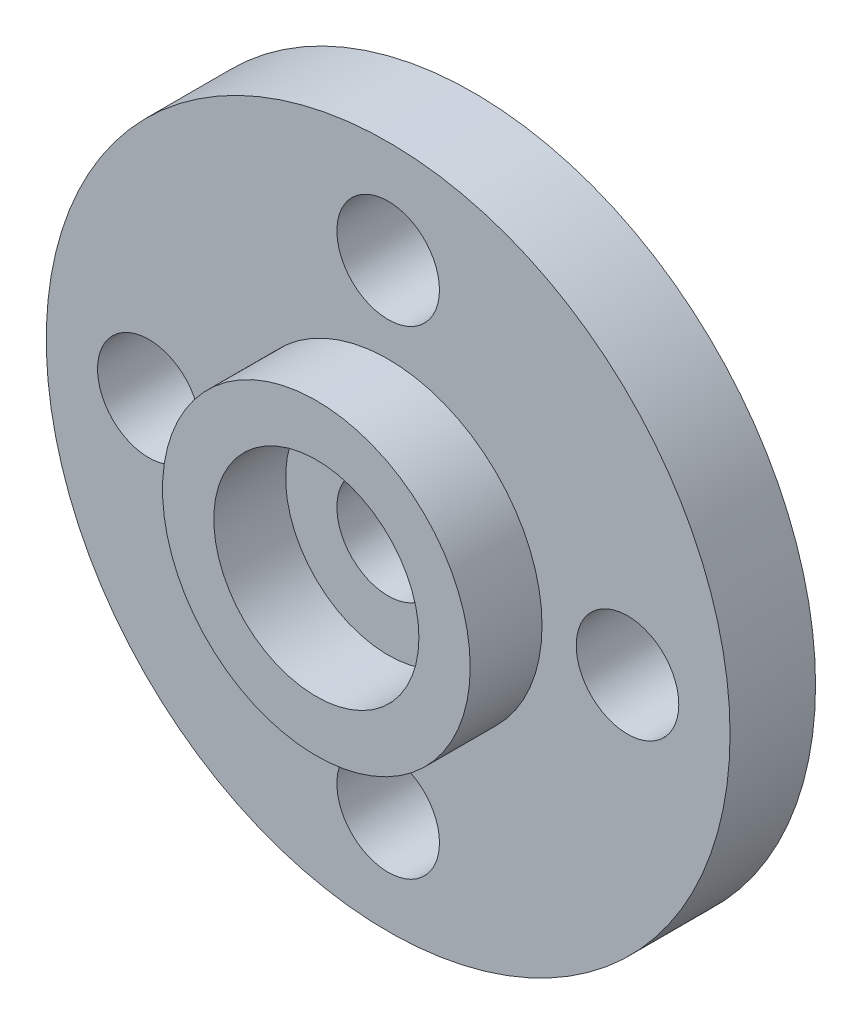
ISO-10303-21;
HEADER;
FILE_DESCRIPTION(('STEP AP214'),'2;1');
FILE_NAME('part.step','',(''),(''),'','','');
FILE_SCHEMA(('AUTOMOTIVE_DESIGN { 1 0 10303 214 1 1 1 1 }'));
ENDSEC;
DATA;
#1=APPLICATION_CONTEXT('core data for automotive mechanical design processes');
#2=APPLICATION_PROTOCOL_DEFINITION('international standard','automotive_design',2000,#1);
#3=PRODUCT_CONTEXT('',#1,'mechanical');
#4=PRODUCT('Part','Part','',(#3));
#5=PRODUCT_RELATED_PRODUCT_CATEGORY('part','',(#4));
#6=PRODUCT_DEFINITION_FORMATION('','',#4);
#7=PRODUCT_DEFINITION_CONTEXT('part definition',#1,'design');
#8=PRODUCT_DEFINITION('design','',#6,#7);
#9=PRODUCT_DEFINITION_SHAPE('','',#8);
#10=(LENGTH_UNIT() NAMED_UNIT(*) SI_UNIT(.MILLI.,.METRE.));
#11=(NAMED_UNIT(*) PLANE_ANGLE_UNIT() SI_UNIT($,.RADIAN.));
#12=(NAMED_UNIT(*) SI_UNIT($,.STERADIAN.) SOLID_ANGLE_UNIT());
#13=UNCERTAINTY_MEASURE_WITH_UNIT(LENGTH_MEASURE(1.E-05),#10,'distance_accuracy_value','');
#14=(GEOMETRIC_REPRESENTATION_CONTEXT(3) GLOBAL_UNCERTAINTY_ASSIGNED_CONTEXT((#13)) GLOBAL_UNIT_ASSIGNED_CONTEXT((#10,
#11,#12)) REPRESENTATION_CONTEXT('',''));
#15=CARTESIAN_POINT('',(0.,0.,0.));
#16=DIRECTION('',(0.,0.,1.));
#17=DIRECTION('',(1.,0.,0.));
#18=AXIS2_PLACEMENT_3D('',#15,#16,#17);
#19=CARTESIAN_POINT('',(0.,0.,2.5));
#20=DIRECTION('',(0.,0.,-1.));
#21=DIRECTION('',(-1.,0.,0.));
#22=AXIS2_PLACEMENT_3D('',#19,#20,#21);
#23=CYLINDRICAL_SURFACE('',#22,10.);
#24=CARTESIAN_POINT('',(0.,0.,2.5));
#25=DIRECTION('',(0.,0.,1.));
#26=DIRECTION('',(1.,0.,0.));
#27=AXIS2_PLACEMENT_3D('',#24,#25,#26);
#28=CIRCLE('',#27,10.);
#29=CARTESIAN_POINT('',(10.,0.,2.5));
#30=VERTEX_POINT('',#29);
#31=EDGE_CURVE('E51',#30,#30,#28,.T.);
#32=ORIENTED_EDGE('',*,*,#31,.F.);
#33=EDGE_LOOP('',(#32));
#34=FACE_BOUND('',#33,.T.);
#35=CARTESIAN_POINT('',(0.,0.,0.));
#36=DIRECTION('',(0.,0.,1.));
#37=DIRECTION('',(1.,0.,0.));
#38=AXIS2_PLACEMENT_3D('',#35,#36,#37);
#39=CIRCLE('',#38,10.);
#40=CARTESIAN_POINT('',(10.,0.,0.));
#41=VERTEX_POINT('',#40);
#42=EDGE_CURVE('E57',#41,#41,#39,.T.);
#43=ORIENTED_EDGE('',*,*,#42,.T.);
#44=EDGE_LOOP('',(#43));
#45=FACE_BOUND('',#44,.T.);
#46=ADVANCED_FACE('F43',(#34,#45),#23,.T.);
#47=CARTESIAN_POINT('',(0.,0.,2.5));
#48=DIRECTION('',(0.,0.,1.));
#49=DIRECTION('',(1.,0.,0.));
#50=AXIS2_PLACEMENT_3D('',#47,#48,#49);
#51=PLANE('',#50);
#52=CARTESIAN_POINT('',(0.,7.,2.5));
#53=DIRECTION('',(0.,0.,1.));
#54=DIRECTION('',(1.,0.,0.));
#55=AXIS2_PLACEMENT_3D('',#52,#53,#54);
#56=CIRCLE('',#55,1.5);
#57=CARTESIAN_POINT('',(1.5,7.,2.5));
#58=VERTEX_POINT('',#57);
#59=EDGE_CURVE('E72',#58,#58,#56,.T.);
#60=ORIENTED_EDGE('',*,*,#59,.F.);
#61=EDGE_LOOP('',(#60));
#62=FACE_BOUND('',#61,.T.);
#63=CARTESIAN_POINT('',(7.,0.,2.5));
#64=DIRECTION('',(0.,0.,1.));
#65=DIRECTION('',(1.,0.,0.));
#66=AXIS2_PLACEMENT_3D('',#63,#64,#65);
#67=CIRCLE('',#66,1.5);
#68=CARTESIAN_POINT('',(8.5,0.,2.5));
#69=VERTEX_POINT('',#68);
#70=EDGE_CURVE('E161',#69,#69,#67,.T.);
#71=ORIENTED_EDGE('',*,*,#70,.F.);
#72=EDGE_LOOP('',(#71));
#73=FACE_BOUND('',#72,.T.);
#74=CARTESIAN_POINT('',(0.,-7.,2.5));
#75=DIRECTION('',(0.,0.,1.));
#76=DIRECTION('',(1.,0.,0.));
#77=AXIS2_PLACEMENT_3D('',#74,#75,#76);
#78=CIRCLE('',#77,1.5);
#79=CARTESIAN_POINT('',(1.49999999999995,-7.,2.5));
#80=VERTEX_POINT('',#79);
#81=EDGE_CURVE('E165',#80,#80,#78,.T.);
#82=ORIENTED_EDGE('',*,*,#81,.F.);
#83=EDGE_LOOP('',(#82));
#84=FACE_BOUND('',#83,.T.);
#85=CARTESIAN_POINT('',(-7.,0.,2.5));
#86=DIRECTION('',(0.,0.,1.));
#87=DIRECTION('',(1.,0.,0.));
#88=AXIS2_PLACEMENT_3D('',#85,#86,#87);
#89=CIRCLE('',#88,1.5);
#90=CARTESIAN_POINT('',(-5.5,0.,2.5));
#91=VERTEX_POINT('',#90);
#92=EDGE_CURVE('E91',#91,#91,#89,.T.);
#93=ORIENTED_EDGE('',*,*,#92,.F.);
#94=EDGE_LOOP('',(#93));
#95=FACE_BOUND('',#94,.T.);
#96=CARTESIAN_POINT('',(0.,0.,2.5));
#97=DIRECTION('',(0.,0.,1.));
#98=DIRECTION('',(1.,0.,0.));
#99=AXIS2_PLACEMENT_3D('',#96,#97,#98);
#100=CIRCLE('',#99,4.5);
#101=CARTESIAN_POINT('',(4.5,0.,2.5));
#102=VERTEX_POINT('',#101);
#103=EDGE_CURVE('E96',#102,#102,#100,.T.);
#104=ORIENTED_EDGE('',*,*,#103,.F.);
#105=EDGE_LOOP('',(#104));
#106=FACE_BOUND('',#105,.T.);
#107=ORIENTED_EDGE('',*,*,#31,.T.);
#108=EDGE_LOOP('',(#107));
#109=FACE_BOUND('',#108,.T.);
#110=ADVANCED_FACE('F107',(#62,#73,#84,#95,#106,#109),#51,.T.);
#111=CARTESIAN_POINT('',(0.,0.,0.));
#112=DIRECTION('',(0.,0.,1.));
#113=DIRECTION('',(1.,0.,0.));
#114=AXIS2_PLACEMENT_3D('',#111,#112,#113);
#115=PLANE('',#114);
#116=CARTESIAN_POINT('',(0.,7.,0.));
#117=DIRECTION('',(0.,0.,1.));
#118=DIRECTION('',(1.,0.,0.));
#119=AXIS2_PLACEMENT_3D('',#116,#117,#118);
#120=CIRCLE('',#119,1.5);
#121=CARTESIAN_POINT('',(1.5,7.,0.));
#122=VERTEX_POINT('',#121);
#123=EDGE_CURVE('E46',#122,#122,#120,.T.);
#124=ORIENTED_EDGE('',*,*,#123,.T.);
#125=EDGE_LOOP('',(#124));
#126=FACE_BOUND('',#125,.T.);
#127=CARTESIAN_POINT('',(7.,0.,0.));
#128=DIRECTION('',(0.,0.,1.));
#129=DIRECTION('',(1.,0.,0.));
#130=AXIS2_PLACEMENT_3D('',#127,#128,#129);
#131=CIRCLE('',#130,1.5);
#132=CARTESIAN_POINT('',(8.5,0.,0.));
#133=VERTEX_POINT('',#132);
#134=EDGE_CURVE('E75',#133,#133,#131,.T.);
#135=ORIENTED_EDGE('',*,*,#134,.T.);
#136=EDGE_LOOP('',(#135));
#137=FACE_BOUND('',#136,.T.);
#138=CARTESIAN_POINT('',(0.,-7.,0.));
#139=DIRECTION('',(0.,0.,1.));
#140=DIRECTION('',(1.,0.,0.));
#141=AXIS2_PLACEMENT_3D('',#138,#139,#140);
#142=CIRCLE('',#141,1.5);
#143=CARTESIAN_POINT('',(1.49999999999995,-7.,0.));
#144=VERTEX_POINT('',#143);
#145=EDGE_CURVE('E71',#144,#144,#142,.T.);
#146=ORIENTED_EDGE('',*,*,#145,.T.);
#147=EDGE_LOOP('',(#146));
#148=FACE_BOUND('',#147,.T.);
#149=CARTESIAN_POINT('',(-7.,0.,0.));
#150=DIRECTION('',(0.,0.,1.));
#151=DIRECTION('',(1.,0.,0.));
#152=AXIS2_PLACEMENT_3D('',#149,#150,#151);
#153=CIRCLE('',#152,1.5);
#154=CARTESIAN_POINT('',(-5.5,0.,0.));
#155=VERTEX_POINT('',#154);
#156=EDGE_CURVE('E67',#155,#155,#153,.T.);
#157=ORIENTED_EDGE('',*,*,#156,.T.);
#158=EDGE_LOOP('',(#157));
#159=FACE_BOUND('',#158,.T.);
#160=CARTESIAN_POINT('',(0.,0.,0.));
#161=DIRECTION('',(0.,0.,1.));
#162=DIRECTION('',(1.,0.,0.));
#163=AXIS2_PLACEMENT_3D('',#160,#161,#162);
#164=CIRCLE('',#163,1.5);
#165=CARTESIAN_POINT('',(1.5,0.,0.));
#166=VERTEX_POINT('',#165);
#167=EDGE_CURVE('E61',#166,#166,#164,.T.);
#168=ORIENTED_EDGE('',*,*,#167,.T.);
#169=EDGE_LOOP('',(#168));
#170=FACE_BOUND('',#169,.T.);
#171=ORIENTED_EDGE('',*,*,#42,.F.);
#172=EDGE_LOOP('',(#171));
#173=FACE_BOUND('',#172,.T.);
#174=ADVANCED_FACE('F110',(#126,#137,#148,#159,#170,#173),#115,.F.);
#175=CARTESIAN_POINT('',(0.,0.,4.6));
#176=DIRECTION('',(0.,0.,1.));
#177=DIRECTION('',(1.,0.,0.));
#178=AXIS2_PLACEMENT_3D('',#175,#176,#177);
#179=PLANE('',#178);
#180=CARTESIAN_POINT('',(0.,0.,4.6));
#181=DIRECTION('',(0.,0.,1.));
#182=DIRECTION('',(1.,0.,0.));
#183=AXIS2_PLACEMENT_3D('',#180,#181,#182);
#184=CIRCLE('',#183,4.5);
#185=CARTESIAN_POINT('',(4.5,0.,4.6));
#186=VERTEX_POINT('',#185);
#187=EDGE_CURVE('E97',#186,#186,#184,.T.);
#188=ORIENTED_EDGE('',*,*,#187,.T.);
#189=EDGE_LOOP('',(#188));
#190=FACE_BOUND('',#189,.T.);
#191=CARTESIAN_POINT('',(0.,0.,4.6));
#192=DIRECTION('',(0.,0.,1.));
#193=DIRECTION('',(1.,0.,0.));
#194=AXIS2_PLACEMENT_3D('',#191,#192,#193);
#195=CIRCLE('',#194,3.);
#196=CARTESIAN_POINT('',(3.,0.,4.6));
#197=VERTEX_POINT('',#196);
#198=EDGE_CURVE('E65',#197,#197,#195,.T.);
#199=ORIENTED_EDGE('',*,*,#198,.F.);
#200=EDGE_LOOP('',(#199));
#201=FACE_BOUND('',#200,.T.);
#202=ADVANCED_FACE('F123',(#190,#201),#179,.T.);
#203=CARTESIAN_POINT('',(0.,0.,4.6));
#204=DIRECTION('',(0.,0.,-1.));
#205=DIRECTION('',(-1.,0.,0.));
#206=AXIS2_PLACEMENT_3D('',#203,#204,#205);
#207=CYLINDRICAL_SURFACE('',#206,4.5);
#208=ORIENTED_EDGE('',*,*,#187,.F.);
#209=EDGE_LOOP('',(#208));
#210=FACE_BOUND('',#209,.T.);
#211=ORIENTED_EDGE('',*,*,#103,.T.);
#212=EDGE_LOOP('',(#211));
#213=FACE_BOUND('',#212,.T.);
#214=ADVANCED_FACE('F105',(#210,#213),#207,.T.);
#215=CARTESIAN_POINT('',(0.,0.,4.6));
#216=DIRECTION('',(0.,0.,-1.));
#217=DIRECTION('',(-1.,0.,0.));
#218=AXIS2_PLACEMENT_3D('',#215,#216,#217);
#219=CYLINDRICAL_SURFACE('',#218,3.);
#220=ORIENTED_EDGE('',*,*,#198,.T.);
#221=EDGE_LOOP('',(#220));
#222=FACE_BOUND('',#221,.T.);
#223=CARTESIAN_POINT('',(0.,0.,2.5));
#224=DIRECTION('',(0.,0.,1.));
#225=DIRECTION('',(1.,0.,0.));
#226=AXIS2_PLACEMENT_3D('',#223,#224,#225);
#227=CIRCLE('',#226,3.);
#228=CARTESIAN_POINT('',(3.,0.,2.5));
#229=VERTEX_POINT('',#228);
#230=EDGE_CURVE('E10',#229,#229,#227,.F.);
#231=ORIENTED_EDGE('',*,*,#230,.T.);
#232=EDGE_LOOP('',(#231));
#233=FACE_BOUND('',#232,.T.);
#234=ADVANCED_FACE('F132',(#222,#233),#219,.F.);
#235=CARTESIAN_POINT('',(0.,0.,2.5));
#236=DIRECTION('',(0.,0.,1.));
#237=DIRECTION('',(1.,0.,0.));
#238=AXIS2_PLACEMENT_3D('',#235,#236,#237);
#239=CIRCLE('',#238,1.5);
#240=CARTESIAN_POINT('',(1.5,0.,2.5));
#241=VERTEX_POINT('',#240);
#242=EDGE_CURVE('E66',#241,#241,#239,.T.);
#243=ORIENTED_EDGE('',*,*,#242,.F.);
#244=EDGE_LOOP('',(#243));
#245=FACE_BOUND('',#244,.T.);
#246=ORIENTED_EDGE('',*,*,#230,.F.);
#247=EDGE_LOOP('',(#246));
#248=FACE_BOUND('',#247,.T.);
#249=ADVANCED_FACE('F113',(#245,#248),#51,.T.);
#250=CARTESIAN_POINT('',(0.,0.,-0.5));
#251=DIRECTION('',(0.,0.,1.));
#252=DIRECTION('',(1.,0.,0.));
#253=AXIS2_PLACEMENT_3D('',#250,#251,#252);
#254=CYLINDRICAL_SURFACE('',#253,1.5);
#255=ORIENTED_EDGE('',*,*,#242,.T.);
#256=EDGE_LOOP('',(#255));
#257=FACE_BOUND('',#256,.T.);
#258=ORIENTED_EDGE('',*,*,#167,.F.);
#259=EDGE_LOOP('',(#258));
#260=FACE_BOUND('',#259,.T.);
#261=ADVANCED_FACE('F138',(#257,#260),#254,.F.);
#262=CARTESIAN_POINT('',(-7.,0.,-0.5));
#263=DIRECTION('',(0.,0.,1.));
#264=DIRECTION('',(1.,0.,0.));
#265=AXIS2_PLACEMENT_3D('',#262,#263,#264);
#266=CYLINDRICAL_SURFACE('',#265,1.5);
#267=ORIENTED_EDGE('',*,*,#92,.T.);
#268=EDGE_LOOP('',(#267));
#269=FACE_BOUND('',#268,.T.);
#270=ORIENTED_EDGE('',*,*,#156,.F.);
#271=EDGE_LOOP('',(#270));
#272=FACE_BOUND('',#271,.T.);
#273=ADVANCED_FACE('F141',(#269,#272),#266,.F.);
#274=CARTESIAN_POINT('',(0.,-7.,-0.5));
#275=DIRECTION('',(0.,0.,1.));
#276=DIRECTION('',(1.,0.,0.));
#277=AXIS2_PLACEMENT_3D('',#274,#275,#276);
#278=CYLINDRICAL_SURFACE('',#277,1.5);
#279=ORIENTED_EDGE('',*,*,#81,.T.);
#280=EDGE_LOOP('',(#279));
#281=FACE_BOUND('',#280,.T.);
#282=ORIENTED_EDGE('',*,*,#145,.F.);
#283=EDGE_LOOP('',(#282));
#284=FACE_BOUND('',#283,.T.);
#285=ADVANCED_FACE('F143',(#281,#284),#278,.F.);
#286=CARTESIAN_POINT('',(7.,0.,-0.5));
#287=DIRECTION('',(0.,0.,1.));
#288=DIRECTION('',(1.,0.,0.));
#289=AXIS2_PLACEMENT_3D('',#286,#287,#288);
#290=CYLINDRICAL_SURFACE('',#289,1.5);
#291=ORIENTED_EDGE('',*,*,#70,.T.);
#292=EDGE_LOOP('',(#291));
#293=FACE_BOUND('',#292,.T.);
#294=ORIENTED_EDGE('',*,*,#134,.F.);
#295=EDGE_LOOP('',(#294));
#296=FACE_BOUND('',#295,.T.);
#297=ADVANCED_FACE('F147',(#293,#296),#290,.F.);
#298=CARTESIAN_POINT('',(0.,7.,-0.5));
#299=DIRECTION('',(0.,0.,1.));
#300=DIRECTION('',(1.,0.,0.));
#301=AXIS2_PLACEMENT_3D('',#298,#299,#300);
#302=CYLINDRICAL_SURFACE('',#301,1.5);
#303=ORIENTED_EDGE('',*,*,#59,.T.);
#304=EDGE_LOOP('',(#303));
#305=FACE_BOUND('',#304,.T.);
#306=ORIENTED_EDGE('',*,*,#123,.F.);
#307=EDGE_LOOP('',(#306));
#308=FACE_BOUND('',#307,.T.);
#309=ADVANCED_FACE('F151',(#305,#308),#302,.F.);
#310=CLOSED_SHELL('',(#46,#110,#174,#202,#214,#234,#249,#261,#273,#285,#297,#309));
#311=MANIFOLD_SOLID_BREP('B2',#310);
#312=ADVANCED_BREP_SHAPE_REPRESENTATION('',(#18,#311),#14);
#313=SHAPE_DEFINITION_REPRESENTATION(#9,#312);
ENDSEC;
END-ISO-10303-21;
